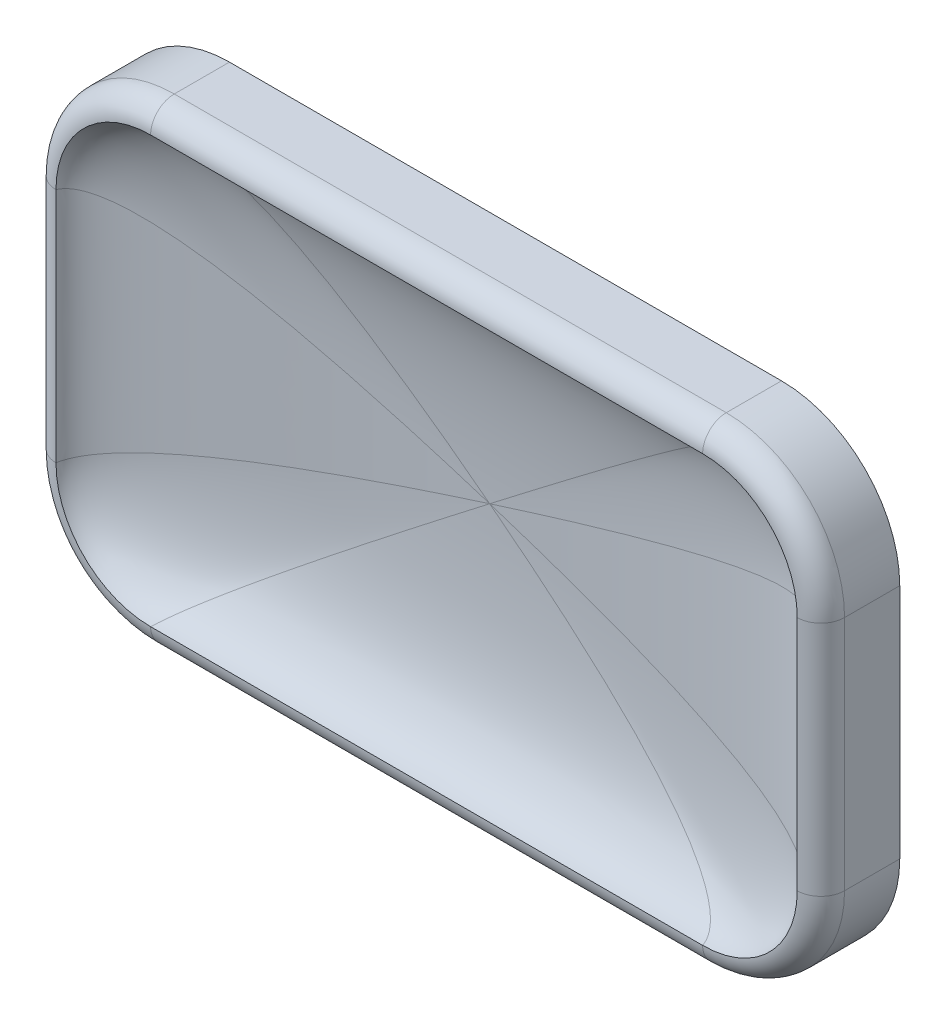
ISO-10303-21;
HEADER;
FILE_DESCRIPTION(('STEP AP214'),'2;1');
FILE_NAME('part.step','',(''),(''),'','','');
FILE_SCHEMA(('AUTOMOTIVE_DESIGN { 1 0 10303 214 1 1 1 1 }'));
ENDSEC;
DATA;
#1=APPLICATION_CONTEXT('core data for automotive mechanical design processes');
#2=APPLICATION_PROTOCOL_DEFINITION('international standard','automotive_design',2000,#1);
#3=PRODUCT_CONTEXT('',#1,'mechanical');
#4=PRODUCT('Part','Part','',(#3));
#5=PRODUCT_RELATED_PRODUCT_CATEGORY('part','',(#4));
#6=PRODUCT_DEFINITION_FORMATION('','',#4);
#7=PRODUCT_DEFINITION_CONTEXT('part definition',#1,'design');
#8=PRODUCT_DEFINITION('design','',#6,#7);
#9=PRODUCT_DEFINITION_SHAPE('','',#8);
#10=(LENGTH_UNIT() NAMED_UNIT(*) SI_UNIT(.MILLI.,.METRE.));
#11=(NAMED_UNIT(*) PLANE_ANGLE_UNIT() SI_UNIT($,.RADIAN.));
#12=(NAMED_UNIT(*) SI_UNIT($,.STERADIAN.) SOLID_ANGLE_UNIT());
#13=UNCERTAINTY_MEASURE_WITH_UNIT(LENGTH_MEASURE(1.E-05),#10,'distance_accuracy_value','');
#14=(GEOMETRIC_REPRESENTATION_CONTEXT(3) GLOBAL_UNCERTAINTY_ASSIGNED_CONTEXT((#13)) GLOBAL_UNIT_ASSIGNED_CONTEXT((#10,
#11,#12)) REPRESENTATION_CONTEXT('',''));
#15=CARTESIAN_POINT('',(0.,0.,0.));
#16=DIRECTION('',(0.,0.,1.));
#17=DIRECTION('',(1.,0.,0.));
#18=AXIS2_PLACEMENT_3D('',#15,#16,#17);
#19=CARTESIAN_POINT('',(0.,0.,10.));
#20=DIRECTION('',(1.,0.,0.));
#21=DIRECTION('',(0.,0.,-1.));
#22=AXIS2_PLACEMENT_3D('',#19,#20,#21);
#23=PLANE('',#22);
#24=DIRECTION('',(0.,0.,-1.));
#25=VECTOR('',#24,1.);
#26=CARTESIAN_POINT('',(0.,15.,10.));
#27=LINE('',#26,#25);
#28=CARTESIAN_POINT('',(0.,15.,0.));
#29=VERTEX_POINT('',#28);
#30=CARTESIAN_POINT('',(0.,15.,7.));
#31=VERTEX_POINT('',#30);
#32=EDGE_CURVE('E217',#29,#31,#27,.F.);
#33=ORIENTED_EDGE('',*,*,#32,.T.);
#34=DIRECTION('',(0.,-1.,0.));
#35=VECTOR('',#34,1.);
#36=CARTESIAN_POINT('',(0.,0.,7.));
#37=LINE('',#36,#35);
#38=CARTESIAN_POINT('',(0.,45.,7.));
#39=VERTEX_POINT('',#38);
#40=EDGE_CURVE('E59',#31,#39,#37,.F.);
#41=ORIENTED_EDGE('',*,*,#40,.T.);
#42=DIRECTION('',(0.,0.,-1.));
#43=VECTOR('',#42,1.);
#44=CARTESIAN_POINT('',(0.,45.,10.));
#45=LINE('',#44,#43);
#46=CARTESIAN_POINT('',(0.,45.,0.));
#47=VERTEX_POINT('',#46);
#48=EDGE_CURVE('E219',#39,#47,#45,.T.);
#49=ORIENTED_EDGE('',*,*,#48,.T.);
#50=DIRECTION('',(0.,-1.,0.));
#51=VECTOR('',#50,1.);
#52=CARTESIAN_POINT('',(0.,0.,0.));
#53=LINE('',#52,#51);
#54=EDGE_CURVE('E193',#47,#29,#53,.T.);
#55=ORIENTED_EDGE('',*,*,#54,.T.);
#56=EDGE_LOOP('',(#33,#41,#49,#55));
#57=FACE_BOUND('',#56,.T.);
#58=ADVANCED_FACE('F35',(#57),#23,.F.);
#59=CARTESIAN_POINT('',(0.,0.,10.));
#60=DIRECTION('',(0.,1.,0.));
#61=DIRECTION('',(0.,0.,1.));
#62=AXIS2_PLACEMENT_3D('',#59,#60,#61);
#63=PLANE('',#62);
#64=DIRECTION('',(0.,0.,-1.));
#65=VECTOR('',#64,1.);
#66=CARTESIAN_POINT('',(85.,0.,10.));
#67=LINE('',#66,#65);
#68=CARTESIAN_POINT('',(85.,0.,0.));
#69=VERTEX_POINT('',#68);
#70=CARTESIAN_POINT('',(85.,0.,7.));
#71=VERTEX_POINT('',#70);
#72=EDGE_CURVE('E240',#69,#71,#67,.F.);
#73=ORIENTED_EDGE('',*,*,#72,.T.);
#74=DIRECTION('',(1.,0.,0.));
#75=VECTOR('',#74,1.);
#76=CARTESIAN_POINT('',(0.,0.,7.));
#77=LINE('',#76,#75);
#78=CARTESIAN_POINT('',(15.,0.,7.));
#79=VERTEX_POINT('',#78);
#80=EDGE_CURVE('E171',#71,#79,#77,.F.);
#81=ORIENTED_EDGE('',*,*,#80,.T.);
#82=DIRECTION('',(0.,0.,-1.));
#83=VECTOR('',#82,1.);
#84=CARTESIAN_POINT('',(15.,0.,10.));
#85=LINE('',#84,#83);
#86=CARTESIAN_POINT('',(15.,0.,0.));
#87=VERTEX_POINT('',#86);
#88=EDGE_CURVE('E238',#79,#87,#85,.T.);
#89=ORIENTED_EDGE('',*,*,#88,.T.);
#90=DIRECTION('',(1.,0.,0.));
#91=VECTOR('',#90,1.);
#92=CARTESIAN_POINT('',(0.,0.,0.));
#93=LINE('',#92,#91);
#94=EDGE_CURVE('E199',#87,#69,#93,.T.);
#95=ORIENTED_EDGE('',*,*,#94,.T.);
#96=EDGE_LOOP('',(#73,#81,#89,#95));
#97=FACE_BOUND('',#96,.T.);
#98=ADVANCED_FACE('F272',(#97),#63,.F.);
#99=CARTESIAN_POINT('',(100.,0.,10.));
#100=DIRECTION('',(-1.,0.,0.));
#101=DIRECTION('',(0.,0.,1.));
#102=AXIS2_PLACEMENT_3D('',#99,#100,#101);
#103=PLANE('',#102);
#104=DIRECTION('',(0.,0.,-1.));
#105=VECTOR('',#104,1.);
#106=CARTESIAN_POINT('',(100.,45.,10.));
#107=LINE('',#106,#105);
#108=CARTESIAN_POINT('',(100.,45.,0.));
#109=VERTEX_POINT('',#108);
#110=CARTESIAN_POINT('',(100.,45.,7.));
#111=VERTEX_POINT('',#110);
#112=EDGE_CURVE('E235',#109,#111,#107,.F.);
#113=ORIENTED_EDGE('',*,*,#112,.T.);
#114=DIRECTION('',(0.,1.,0.));
#115=VECTOR('',#114,1.);
#116=CARTESIAN_POINT('',(100.,0.,7.));
#117=LINE('',#116,#115);
#118=CARTESIAN_POINT('',(100.,15.,7.));
#119=VERTEX_POINT('',#118);
#120=EDGE_CURVE('E154',#111,#119,#117,.F.);
#121=ORIENTED_EDGE('',*,*,#120,.T.);
#122=DIRECTION('',(0.,0.,-1.));
#123=VECTOR('',#122,1.);
#124=CARTESIAN_POINT('',(100.,15.,10.));
#125=LINE('',#124,#123);
#126=CARTESIAN_POINT('',(100.,15.,0.));
#127=VERTEX_POINT('',#126);
#128=EDGE_CURVE('E233',#119,#127,#125,.T.);
#129=ORIENTED_EDGE('',*,*,#128,.T.);
#130=DIRECTION('',(0.,1.,0.));
#131=VECTOR('',#130,1.);
#132=CARTESIAN_POINT('',(100.,0.,0.));
#133=LINE('',#132,#131);
#134=EDGE_CURVE('E204',#127,#109,#133,.T.);
#135=ORIENTED_EDGE('',*,*,#134,.T.);
#136=EDGE_LOOP('',(#113,#121,#129,#135));
#137=FACE_BOUND('',#136,.T.);
#138=ADVANCED_FACE('F294',(#137),#103,.F.);
#139=CARTESIAN_POINT('',(0.,60.,10.));
#140=DIRECTION('',(0.,-1.,0.));
#141=DIRECTION('',(0.,0.,-1.));
#142=AXIS2_PLACEMENT_3D('',#139,#140,#141);
#143=PLANE('',#142);
#144=DIRECTION('',(0.,0.,-1.));
#145=VECTOR('',#144,1.);
#146=CARTESIAN_POINT('',(15.,60.,10.));
#147=LINE('',#146,#145);
#148=CARTESIAN_POINT('',(15.,60.,0.));
#149=VERTEX_POINT('',#148);
#150=CARTESIAN_POINT('',(15.,60.,7.));
#151=VERTEX_POINT('',#150);
#152=EDGE_CURVE('E231',#149,#151,#147,.F.);
#153=ORIENTED_EDGE('',*,*,#152,.T.);
#154=DIRECTION('',(-1.,0.,0.));
#155=VECTOR('',#154,1.);
#156=CARTESIAN_POINT('',(0.,60.,7.));
#157=LINE('',#156,#155);
#158=CARTESIAN_POINT('',(85.,60.,7.));
#159=VERTEX_POINT('',#158);
#160=EDGE_CURVE('E11',#151,#159,#157,.F.);
#161=ORIENTED_EDGE('',*,*,#160,.T.);
#162=DIRECTION('',(0.,0.,-1.));
#163=VECTOR('',#162,1.);
#164=CARTESIAN_POINT('',(85.,60.,10.));
#165=LINE('',#164,#163);
#166=CARTESIAN_POINT('',(85.,60.,0.));
#167=VERTEX_POINT('',#166);
#168=EDGE_CURVE('E229',#159,#167,#165,.T.);
#169=ORIENTED_EDGE('',*,*,#168,.T.);
#170=DIRECTION('',(-1.,0.,0.));
#171=VECTOR('',#170,1.);
#172=CARTESIAN_POINT('',(0.,60.,0.));
#173=LINE('',#172,#171);
#174=EDGE_CURVE('E214',#167,#149,#173,.T.);
#175=ORIENTED_EDGE('',*,*,#174,.T.);
#176=EDGE_LOOP('',(#153,#161,#169,#175));
#177=FACE_BOUND('',#176,.T.);
#178=ADVANCED_FACE('F355',(#177),#143,.F.);
#179=CARTESIAN_POINT('',(0.,60.,0.));
#180=DIRECTION('',(0.,0.,-1.));
#181=DIRECTION('',(-1.,0.,0.));
#182=AXIS2_PLACEMENT_3D('',#179,#180,#181);
#183=PLANE('',#182);
#184=ORIENTED_EDGE('',*,*,#54,.F.);
#185=CARTESIAN_POINT('',(15.,45.,0.));
#186=DIRECTION('',(0.,0.,-1.));
#187=DIRECTION('',(-1.,0.,0.));
#188=AXIS2_PLACEMENT_3D('',#185,#186,#187);
#189=CIRCLE('',#188,15.);
#190=EDGE_CURVE('E227',#47,#149,#189,.T.);
#191=ORIENTED_EDGE('',*,*,#190,.T.);
#192=ORIENTED_EDGE('',*,*,#174,.F.);
#193=CARTESIAN_POINT('',(85.,45.,0.));
#194=DIRECTION('',(0.,0.,-1.));
#195=DIRECTION('',(-1.,0.,0.));
#196=AXIS2_PLACEMENT_3D('',#193,#194,#195);
#197=CIRCLE('',#196,15.);
#198=EDGE_CURVE('E225',#167,#109,#197,.T.);
#199=ORIENTED_EDGE('',*,*,#198,.T.);
#200=ORIENTED_EDGE('',*,*,#134,.F.);
#201=CARTESIAN_POINT('',(85.,15.,0.));
#202=DIRECTION('',(0.,0.,-1.));
#203=DIRECTION('',(-1.,0.,0.));
#204=AXIS2_PLACEMENT_3D('',#201,#202,#203);
#205=CIRCLE('',#204,15.);
#206=EDGE_CURVE('E223',#127,#69,#205,.T.);
#207=ORIENTED_EDGE('',*,*,#206,.T.);
#208=ORIENTED_EDGE('',*,*,#94,.F.);
#209=CARTESIAN_POINT('',(15.,15.,0.));
#210=DIRECTION('',(0.,0.,-1.));
#211=DIRECTION('',(-1.,0.,0.));
#212=AXIS2_PLACEMENT_3D('',#209,#210,#211);
#213=CIRCLE('',#212,15.);
#214=EDGE_CURVE('E221',#87,#29,#213,.T.);
#215=ORIENTED_EDGE('',*,*,#214,.T.);
#216=EDGE_LOOP('',(#184,#191,#192,#199,#200,#207,#208,#215));
#217=FACE_BOUND('',#216,.T.);
#218=ADVANCED_FACE('F302',(#217),#183,.T.);
#219=CARTESIAN_POINT('',(15.,45.,10.));
#220=DIRECTION('',(0.,0.,-1.));
#221=DIRECTION('',(-1.,0.,0.));
#222=AXIS2_PLACEMENT_3D('',#219,#220,#221);
#223=CYLINDRICAL_SURFACE('',#222,15.);
#224=ORIENTED_EDGE('',*,*,#48,.F.);
#225=CARTESIAN_POINT('',(15.,45.,7.));
#226=DIRECTION('',(0.,0.,-1.));
#227=DIRECTION('',(-1.,0.,0.));
#228=AXIS2_PLACEMENT_3D('',#225,#226,#227);
#229=CIRCLE('',#228,15.);
#230=EDGE_CURVE('E44',#39,#151,#229,.T.);
#231=ORIENTED_EDGE('',*,*,#230,.T.);
#232=ORIENTED_EDGE('',*,*,#152,.F.);
#233=ORIENTED_EDGE('',*,*,#190,.F.);
#234=EDGE_LOOP('',(#224,#231,#232,#233));
#235=FACE_BOUND('',#234,.T.);
#236=ADVANCED_FACE('F298',(#235),#223,.T.);
#237=CARTESIAN_POINT('',(85.,45.,10.));
#238=DIRECTION('',(0.,0.,-1.));
#239=DIRECTION('',(-1.,0.,0.));
#240=AXIS2_PLACEMENT_3D('',#237,#238,#239);
#241=CYLINDRICAL_SURFACE('',#240,15.);
#242=ORIENTED_EDGE('',*,*,#168,.F.);
#243=CARTESIAN_POINT('',(85.,45.,7.));
#244=DIRECTION('',(0.,0.,-1.));
#245=DIRECTION('',(-1.,0.,0.));
#246=AXIS2_PLACEMENT_3D('',#243,#244,#245);
#247=CIRCLE('',#246,15.);
#248=EDGE_CURVE('E163',#159,#111,#247,.T.);
#249=ORIENTED_EDGE('',*,*,#248,.T.);
#250=ORIENTED_EDGE('',*,*,#112,.F.);
#251=ORIENTED_EDGE('',*,*,#198,.F.);
#252=EDGE_LOOP('',(#242,#249,#250,#251));
#253=FACE_BOUND('',#252,.T.);
#254=ADVANCED_FACE('F301',(#253),#241,.T.);
#255=CARTESIAN_POINT('',(85.,15.,10.));
#256=DIRECTION('',(0.,0.,-1.));
#257=DIRECTION('',(-1.,0.,0.));
#258=AXIS2_PLACEMENT_3D('',#255,#256,#257);
#259=CYLINDRICAL_SURFACE('',#258,15.);
#260=ORIENTED_EDGE('',*,*,#128,.F.);
#261=CARTESIAN_POINT('',(85.,15.,7.));
#262=DIRECTION('',(0.,0.,-1.));
#263=DIRECTION('',(-1.,0.,0.));
#264=AXIS2_PLACEMENT_3D('',#261,#262,#263);
#265=CIRCLE('',#264,15.);
#266=EDGE_CURVE('E169',#119,#71,#265,.T.);
#267=ORIENTED_EDGE('',*,*,#266,.T.);
#268=ORIENTED_EDGE('',*,*,#72,.F.);
#269=ORIENTED_EDGE('',*,*,#206,.F.);
#270=EDGE_LOOP('',(#260,#267,#268,#269));
#271=FACE_BOUND('',#270,.T.);
#272=ADVANCED_FACE('F269',(#271),#259,.T.);
#273=CARTESIAN_POINT('',(15.,15.,10.));
#274=DIRECTION('',(0.,0.,-1.));
#275=DIRECTION('',(-1.,0.,0.));
#276=AXIS2_PLACEMENT_3D('',#273,#274,#275);
#277=CYLINDRICAL_SURFACE('',#276,15.);
#278=ORIENTED_EDGE('',*,*,#88,.F.);
#279=CARTESIAN_POINT('',(15.,15.,7.));
#280=DIRECTION('',(0.,0.,-1.));
#281=DIRECTION('',(-1.,0.,0.));
#282=AXIS2_PLACEMENT_3D('',#279,#280,#281);
#283=CIRCLE('',#282,15.);
#284=EDGE_CURVE('E173',#79,#31,#283,.T.);
#285=ORIENTED_EDGE('',*,*,#284,.T.);
#286=ORIENTED_EDGE('',*,*,#32,.F.);
#287=ORIENTED_EDGE('',*,*,#214,.F.);
#288=EDGE_LOOP('',(#278,#285,#286,#287));
#289=FACE_BOUND('',#288,.T.);
#290=ADVANCED_FACE('F287',(#289),#277,.T.);
#291=CARTESIAN_POINT('',(15.,15.,7.));
#292=DIRECTION('',(0.,0.,-1.));
#293=DIRECTION('',(-1.,0.,0.));
#294=AXIS2_PLACEMENT_3D('',#291,#292,#293);
#295=TOROIDAL_SURFACE('',#294,12.,3.);
#296=CARTESIAN_POINT('',(3.,15.,7.));
#297=DIRECTION('',(0.,1.,0.));
#298=DIRECTION('',(0.,0.,1.));
#299=AXIS2_PLACEMENT_3D('',#296,#297,#298);
#300=CIRCLE('',#299,3.);
#301=CARTESIAN_POINT('',(3.,15.,10.));
#302=VERTEX_POINT('',#301);
#303=EDGE_CURVE('E187',#31,#302,#300,.T.);
#304=ORIENTED_EDGE('',*,*,#303,.F.);
#305=ORIENTED_EDGE('',*,*,#284,.F.);
#306=CARTESIAN_POINT('',(15.,3.,7.));
#307=DIRECTION('',(1.,0.,0.));
#308=DIRECTION('',(0.,0.,-1.));
#309=AXIS2_PLACEMENT_3D('',#306,#307,#308);
#310=CIRCLE('',#309,3.);
#311=CARTESIAN_POINT('',(15.,3.,10.));
#312=VERTEX_POINT('',#311);
#313=EDGE_CURVE('E39',#312,#79,#310,.T.);
#314=ORIENTED_EDGE('',*,*,#313,.F.);
#315=CARTESIAN_POINT('',(15.,15.,10.));
#316=DIRECTION('',(0.,0.,-1.));
#317=DIRECTION('',(-1.,0.,0.));
#318=AXIS2_PLACEMENT_3D('',#315,#316,#317);
#319=CIRCLE('',#318,12.);
#320=EDGE_CURVE('E252',#302,#312,#319,.F.);
#321=ORIENTED_EDGE('',*,*,#320,.F.);
#322=EDGE_LOOP('',(#304,#305,#314,#321));
#323=FACE_BOUND('',#322,.T.);
#324=ADVANCED_FACE('F37',(#323),#295,.T.);
#325=CARTESIAN_POINT('',(0.,3.,7.));
#326=DIRECTION('',(1.,0.,0.));
#327=DIRECTION('',(0.,0.,-1.));
#328=AXIS2_PLACEMENT_3D('',#325,#326,#327);
#329=CYLINDRICAL_SURFACE('',#328,3.);
#330=ORIENTED_EDGE('',*,*,#313,.T.);
#331=ORIENTED_EDGE('',*,*,#80,.F.);
#332=CARTESIAN_POINT('',(85.,3.,7.));
#333=DIRECTION('',(1.,0.,0.));
#334=DIRECTION('',(0.,0.,-1.));
#335=AXIS2_PLACEMENT_3D('',#332,#333,#334);
#336=CIRCLE('',#335,3.);
#337=CARTESIAN_POINT('',(85.,3.,10.));
#338=VERTEX_POINT('',#337);
#339=EDGE_CURVE('E185',#338,#71,#336,.T.);
#340=ORIENTED_EDGE('',*,*,#339,.F.);
#341=DIRECTION('',(1.,0.,0.));
#342=VECTOR('',#341,1.);
#343=CARTESIAN_POINT('',(0.,3.,10.));
#344=LINE('',#343,#342);
#345=EDGE_CURVE('E255',#312,#338,#344,.T.);
#346=ORIENTED_EDGE('',*,*,#345,.F.);
#347=EDGE_LOOP('',(#330,#331,#340,#346));
#348=FACE_BOUND('',#347,.T.);
#349=ADVANCED_FACE('F275',(#348),#329,.T.);
#350=CARTESIAN_POINT('',(3.,60.,7.));
#351=DIRECTION('',(0.,-1.,0.));
#352=DIRECTION('',(0.,0.,-1.));
#353=AXIS2_PLACEMENT_3D('',#350,#351,#352);
#354=CYLINDRICAL_SURFACE('',#353,3.);
#355=ORIENTED_EDGE('',*,*,#303,.T.);
#356=DIRECTION('',(0.,-1.,0.));
#357=VECTOR('',#356,1.);
#358=CARTESIAN_POINT('',(3.,60.,10.));
#359=LINE('',#358,#357);
#360=CARTESIAN_POINT('',(3.,45.,10.));
#361=VERTEX_POINT('',#360);
#362=EDGE_CURVE('E249',#361,#302,#359,.T.);
#363=ORIENTED_EDGE('',*,*,#362,.F.);
#364=CARTESIAN_POINT('',(3.,45.,7.));
#365=DIRECTION('',(0.,1.,0.));
#366=DIRECTION('',(0.,0.,1.));
#367=AXIS2_PLACEMENT_3D('',#364,#365,#366);
#368=CIRCLE('',#367,3.);
#369=EDGE_CURVE('E182',#39,#361,#368,.T.);
#370=ORIENTED_EDGE('',*,*,#369,.F.);
#371=ORIENTED_EDGE('',*,*,#40,.F.);
#372=EDGE_LOOP('',(#355,#363,#370,#371));
#373=FACE_BOUND('',#372,.T.);
#374=ADVANCED_FACE('F324',(#373),#354,.T.);
#375=CARTESIAN_POINT('',(85.,15.,7.));
#376=DIRECTION('',(0.,0.,-1.));
#377=DIRECTION('',(-1.,0.,0.));
#378=AXIS2_PLACEMENT_3D('',#375,#376,#377);
#379=TOROIDAL_SURFACE('',#378,12.,3.);
#380=ORIENTED_EDGE('',*,*,#339,.T.);
#381=ORIENTED_EDGE('',*,*,#266,.F.);
#382=CARTESIAN_POINT('',(97.,15.,7.));
#383=DIRECTION('',(0.,1.,0.));
#384=DIRECTION('',(0.,0.,1.));
#385=AXIS2_PLACEMENT_3D('',#382,#383,#384);
#386=CIRCLE('',#385,3.);
#387=CARTESIAN_POINT('',(97.,15.,10.));
#388=VERTEX_POINT('',#387);
#389=EDGE_CURVE('E180',#388,#119,#386,.T.);
#390=ORIENTED_EDGE('',*,*,#389,.F.);
#391=CARTESIAN_POINT('',(85.,15.,10.));
#392=DIRECTION('',(0.,0.,-1.));
#393=DIRECTION('',(-1.,0.,0.));
#394=AXIS2_PLACEMENT_3D('',#391,#392,#393);
#395=CIRCLE('',#394,12.);
#396=EDGE_CURVE('E149',#338,#388,#395,.F.);
#397=ORIENTED_EDGE('',*,*,#396,.F.);
#398=EDGE_LOOP('',(#380,#381,#390,#397));
#399=FACE_BOUND('',#398,.T.);
#400=ADVANCED_FACE('F265',(#399),#379,.T.);
#401=CARTESIAN_POINT('',(15.,45.,7.));
#402=DIRECTION('',(0.,0.,-1.));
#403=DIRECTION('',(-1.,0.,0.));
#404=AXIS2_PLACEMENT_3D('',#401,#402,#403);
#405=TOROIDAL_SURFACE('',#404,12.,3.);
#406=ORIENTED_EDGE('',*,*,#369,.T.);
#407=CARTESIAN_POINT('',(15.,45.,10.));
#408=DIRECTION('',(0.,0.,-1.));
#409=DIRECTION('',(-1.,0.,0.));
#410=AXIS2_PLACEMENT_3D('',#407,#408,#409);
#411=CIRCLE('',#410,12.);
#412=CARTESIAN_POINT('',(15.,57.,10.));
#413=VERTEX_POINT('',#412);
#414=EDGE_CURVE('E246',#413,#361,#411,.F.);
#415=ORIENTED_EDGE('',*,*,#414,.F.);
#416=CARTESIAN_POINT('',(15.,57.,7.));
#417=DIRECTION('',(1.,0.,0.));
#418=DIRECTION('',(0.,0.,-1.));
#419=AXIS2_PLACEMENT_3D('',#416,#417,#418);
#420=CIRCLE('',#419,3.);
#421=EDGE_CURVE('E158',#151,#413,#420,.T.);
#422=ORIENTED_EDGE('',*,*,#421,.F.);
#423=ORIENTED_EDGE('',*,*,#230,.F.);
#424=EDGE_LOOP('',(#406,#415,#422,#423));
#425=FACE_BOUND('',#424,.T.);
#426=ADVANCED_FACE('F318',(#425),#405,.T.);
#427=CARTESIAN_POINT('',(97.,60.,7.));
#428=DIRECTION('',(0.,1.,0.));
#429=DIRECTION('',(0.,0.,1.));
#430=AXIS2_PLACEMENT_3D('',#427,#428,#429);
#431=CYLINDRICAL_SURFACE('',#430,3.);
#432=ORIENTED_EDGE('',*,*,#389,.T.);
#433=ORIENTED_EDGE('',*,*,#120,.F.);
#434=CARTESIAN_POINT('',(97.,45.,7.));
#435=DIRECTION('',(0.,1.,0.));
#436=DIRECTION('',(0.,0.,1.));
#437=AXIS2_PLACEMENT_3D('',#434,#435,#436);
#438=CIRCLE('',#437,3.);
#439=CARTESIAN_POINT('',(97.,45.,10.));
#440=VERTEX_POINT('',#439);
#441=EDGE_CURVE('E152',#440,#111,#438,.T.);
#442=ORIENTED_EDGE('',*,*,#441,.F.);
#443=DIRECTION('',(0.,1.,0.));
#444=VECTOR('',#443,1.);
#445=CARTESIAN_POINT('',(97.,60.,10.));
#446=LINE('',#445,#444);
#447=EDGE_CURVE('E143',#388,#440,#446,.T.);
#448=ORIENTED_EDGE('',*,*,#447,.F.);
#449=EDGE_LOOP('',(#432,#433,#442,#448));
#450=FACE_BOUND('',#449,.T.);
#451=ADVANCED_FACE('F153',(#450),#431,.T.);
#452=CARTESIAN_POINT('',(0.,57.,7.));
#453=DIRECTION('',(-1.,0.,0.));
#454=DIRECTION('',(0.,0.,1.));
#455=AXIS2_PLACEMENT_3D('',#452,#453,#454);
#456=CYLINDRICAL_SURFACE('',#455,3.);
#457=ORIENTED_EDGE('',*,*,#421,.T.);
#458=DIRECTION('',(-1.,0.,0.));
#459=VECTOR('',#458,1.);
#460=CARTESIAN_POINT('',(0.,57.,10.));
#461=LINE('',#460,#459);
#462=CARTESIAN_POINT('',(85.,57.,10.));
#463=VERTEX_POINT('',#462);
#464=EDGE_CURVE('E243',#463,#413,#461,.T.);
#465=ORIENTED_EDGE('',*,*,#464,.F.);
#466=CARTESIAN_POINT('',(85.,57.,7.));
#467=DIRECTION('',(1.,0.,0.));
#468=DIRECTION('',(0.,0.,-1.));
#469=AXIS2_PLACEMENT_3D('',#466,#467,#468);
#470=CIRCLE('',#469,3.);
#471=EDGE_CURVE('E139',#159,#463,#470,.T.);
#472=ORIENTED_EDGE('',*,*,#471,.F.);
#473=ORIENTED_EDGE('',*,*,#160,.F.);
#474=EDGE_LOOP('',(#457,#465,#472,#473));
#475=FACE_BOUND('',#474,.T.);
#476=ADVANCED_FACE('F312',(#475),#456,.T.);
#477=CARTESIAN_POINT('',(85.,45.,7.));
#478=DIRECTION('',(0.,0.,-1.));
#479=DIRECTION('',(-1.,0.,0.));
#480=AXIS2_PLACEMENT_3D('',#477,#478,#479);
#481=TOROIDAL_SURFACE('',#480,12.,3.);
#482=ORIENTED_EDGE('',*,*,#441,.T.);
#483=ORIENTED_EDGE('',*,*,#248,.F.);
#484=ORIENTED_EDGE('',*,*,#471,.T.);
#485=CARTESIAN_POINT('',(85.,45.,10.));
#486=DIRECTION('',(0.,0.,-1.));
#487=DIRECTION('',(-1.,0.,0.));
#488=AXIS2_PLACEMENT_3D('',#485,#486,#487);
#489=CIRCLE('',#488,12.);
#490=EDGE_CURVE('E134',#440,#463,#489,.F.);
#491=ORIENTED_EDGE('',*,*,#490,.F.);
#492=EDGE_LOOP('',(#482,#483,#484,#491));
#493=FACE_BOUND('',#492,.T.);
#494=ADVANCED_FACE('F160',(#493),#481,.T.);
#495=CARTESIAN_POINT('',(15.,3.,10.));
#496=CARTESIAN_POINT('',(16.75,4.35,2.));
#497=CARTESIAN_POINT('',(50.,30.,2.));
#498=CARTESIAN_POINT('',(85.,3.,10.));
#499=CARTESIAN_POINT('',(83.25,4.35,2.));
#500=CARTESIAN_POINT('',(50.,30.,2.));
#501=(BOUNDED_SURFACE() B_SPLINE_SURFACE(1,2,((#495,#496,#497),(#498,#499,#500)),.UNSPECIFIED.,
.F.,.F.,.F.) B_SPLINE_SURFACE_WITH_KNOTS((2,2),(3,3),(0.,1.),(0.,1.),
.UNSPECIFIED.) GEOMETRIC_REPRESENTATION_ITEM() RATIONAL_B_SPLINE_SURFACE(((1.,1.,1.),(1.,1.,1.))) REPRESENTATION_ITEM('') SURFACE());
#502=CARTESIAN_POINT('',(85.,3.,10.));
#503=CARTESIAN_POINT('',(83.25,4.35,2.));
#504=CARTESIAN_POINT('',(50.,30.,2.));
#505=(BOUNDED_CURVE() B_SPLINE_CURVE(2,(#502,#503,#504),.UNSPECIFIED.,.F.,
.F.) B_SPLINE_CURVE_WITH_KNOTS((3,3),(0.,1.),
.UNSPECIFIED.) CURVE() GEOMETRIC_REPRESENTATION_ITEM() RATIONAL_B_SPLINE_CURVE((1.,1.,1.)) REPRESENTATION_ITEM(''));
#506=CARTESIAN_POINT('',(50.,30.,2.));
#507=VERTEX_POINT('',#506);
#508=EDGE_CURVE('E207',#338,#507,#505,.T.);
#509=CARTESIAN_POINT('',(15.,3.,10.));
#510=CARTESIAN_POINT('',(16.75,4.35,2.));
#511=CARTESIAN_POINT('',(50.,30.,2.));
#512=(BOUNDED_CURVE() B_SPLINE_CURVE(2,(#509,#510,#511),.UNSPECIFIED.,.F.,
.F.) B_SPLINE_CURVE_WITH_KNOTS((3,3),(0.,1.),
.UNSPECIFIED.) CURVE() GEOMETRIC_REPRESENTATION_ITEM() RATIONAL_B_SPLINE_CURVE((1.,1.,1.)) REPRESENTATION_ITEM(''));
#513=EDGE_CURVE('E278',#312,#507,#512,.T.);
#514=ORIENTED_EDGE('',*,*,#345,.T.);
#515=ORIENTED_EDGE('',*,*,#508,.T.);
#516=ORIENTED_EDGE('',*,*,#513,.F.);
#517=EDGE_LOOP('',(#514,#515,#516));
#518=FACE_BOUND('',#517,.T.);
#519=ADVANCED_FACE('F277',(#518),#501,.T.);
#520=CARTESIAN_POINT('',(3.,15.,10.));
#521=CARTESIAN_POINT('',(5.35,15.75,2.));
#522=CARTESIAN_POINT('',(50.,30.,2.));
#523=CARTESIAN_POINT('',(3.,7.97056274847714,10.));
#524=CARTESIAN_POINT('',(5.35,9.07203461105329,2.));
#525=CARTESIAN_POINT('',(50.,30.,2.));
#526=CARTESIAN_POINT('',(7.97056274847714,3.,10.));
#527=CARTESIAN_POINT('',(10.0720346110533,4.35,2.));
#528=CARTESIAN_POINT('',(50.,30.,2.));
#529=CARTESIAN_POINT('',(15.,3.,10.));
#530=CARTESIAN_POINT('',(16.75,4.35,2.));
#531=CARTESIAN_POINT('',(50.,30.,2.));
#532=(BOUNDED_SURFACE() B_SPLINE_SURFACE(3,2,((#520,#521,#522),(#523,#524,#525),(#526,#527,
#528),(#529,#530,#531)),.UNSPECIFIED.,.F.,.F.,.F.) B_SPLINE_SURFACE_WITH_KNOTS((4,4),(3,3),(0.,
1.),(0.,1.),.UNSPECIFIED.) GEOMETRIC_REPRESENTATION_ITEM() RATIONAL_B_SPLINE_SURFACE(((1.,1.,
1.),(0.804737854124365,0.804737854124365,0.804737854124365),(0.804737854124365,
0.804737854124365,0.804737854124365),(1.,1.,1.))) REPRESENTATION_ITEM('') SURFACE());
#533=CARTESIAN_POINT('',(3.,15.,10.));
#534=CARTESIAN_POINT('',(5.35000000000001,15.75,2.));
#535=CARTESIAN_POINT('',(50.,30.,2.));
#536=(BOUNDED_CURVE() B_SPLINE_CURVE(2,(#533,#534,#535),.UNSPECIFIED.,.F.,
.F.) B_SPLINE_CURVE_WITH_KNOTS((3,3),(0.,1.),
.UNSPECIFIED.) CURVE() GEOMETRIC_REPRESENTATION_ITEM() RATIONAL_B_SPLINE_CURVE((1.,1.,1.)) REPRESENTATION_ITEM(''));
#537=EDGE_CURVE('E281',#302,#507,#536,.T.);
#538=ORIENTED_EDGE('',*,*,#320,.T.);
#539=ORIENTED_EDGE('',*,*,#513,.T.);
#540=ORIENTED_EDGE('',*,*,#537,.F.);
#541=EDGE_LOOP('',(#538,#539,#540));
#542=FACE_BOUND('',#541,.T.);
#543=ADVANCED_FACE('F283',(#542),#532,.T.);
#544=CARTESIAN_POINT('',(3.,45.,10.));
#545=CARTESIAN_POINT('',(5.35000000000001,44.25,2.));
#546=CARTESIAN_POINT('',(50.,30.,2.));
#547=CARTESIAN_POINT('',(3.,15.,10.));
#548=CARTESIAN_POINT('',(5.35000000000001,15.75,2.));
#549=CARTESIAN_POINT('',(50.,30.,2.));
#550=(BOUNDED_SURFACE() B_SPLINE_SURFACE(1,2,((#544,#545,#546),(#547,#548,#549)),.UNSPECIFIED.,
.F.,.F.,.F.) B_SPLINE_SURFACE_WITH_KNOTS((2,2),(3,3),(0.,1.),(0.,1.),
.UNSPECIFIED.) GEOMETRIC_REPRESENTATION_ITEM() RATIONAL_B_SPLINE_SURFACE(((1.,1.,1.),(1.,1.,1.))) REPRESENTATION_ITEM('') SURFACE());
#551=CARTESIAN_POINT('',(3.,45.,10.));
#552=CARTESIAN_POINT('',(5.35,44.25,2.));
#553=CARTESIAN_POINT('',(50.,30.,2.));
#554=(BOUNDED_CURVE() B_SPLINE_CURVE(2,(#551,#552,#553),.UNSPECIFIED.,.F.,
.F.) B_SPLINE_CURVE_WITH_KNOTS((3,3),(0.,1.),
.UNSPECIFIED.) CURVE() GEOMETRIC_REPRESENTATION_ITEM() RATIONAL_B_SPLINE_CURVE((1.,1.,1.)) REPRESENTATION_ITEM(''));
#555=EDGE_CURVE('E584',#361,#507,#554,.T.);
#556=ORIENTED_EDGE('',*,*,#362,.T.);
#557=ORIENTED_EDGE('',*,*,#537,.T.);
#558=ORIENTED_EDGE('',*,*,#555,.F.);
#559=EDGE_LOOP('',(#556,#557,#558));
#560=FACE_BOUND('',#559,.T.);
#561=ADVANCED_FACE('F452',(#560),#550,.T.);
#562=CARTESIAN_POINT('',(15.,57.,10.));
#563=CARTESIAN_POINT('',(16.75,55.65,2.));
#564=CARTESIAN_POINT('',(50.,30.,2.));
#565=CARTESIAN_POINT('',(7.97056274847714,57.,10.));
#566=CARTESIAN_POINT('',(10.0720346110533,55.65,2.));
#567=CARTESIAN_POINT('',(50.,30.,2.));
#568=CARTESIAN_POINT('',(3.,52.0294372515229,10.));
#569=CARTESIAN_POINT('',(5.35,50.9279653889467,2.));
#570=CARTESIAN_POINT('',(50.,30.,2.));
#571=CARTESIAN_POINT('',(3.,45.,10.));
#572=CARTESIAN_POINT('',(5.35,44.25,2.));
#573=CARTESIAN_POINT('',(50.,30.,2.));
#574=(BOUNDED_SURFACE() B_SPLINE_SURFACE(3,2,((#562,#563,#564),(#565,#566,#567),(#568,#569,
#570),(#571,#572,#573)),.UNSPECIFIED.,.F.,.F.,.F.) B_SPLINE_SURFACE_WITH_KNOTS((4,4),(3,3),(0.,
1.),(0.,1.),.UNSPECIFIED.) GEOMETRIC_REPRESENTATION_ITEM() RATIONAL_B_SPLINE_SURFACE(((1.,1.,
1.),(0.804737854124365,0.804737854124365,0.804737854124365),(0.804737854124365,
0.804737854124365,0.804737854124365),(1.,1.,1.))) REPRESENTATION_ITEM('') SURFACE());
#575=CARTESIAN_POINT('',(15.,57.,10.));
#576=CARTESIAN_POINT('',(16.75,55.65,2.));
#577=CARTESIAN_POINT('',(50.,30.,2.));
#578=(BOUNDED_CURVE() B_SPLINE_CURVE(2,(#575,#576,#577),.UNSPECIFIED.,.F.,
.F.) B_SPLINE_CURVE_WITH_KNOTS((3,3),(0.,1.),
.UNSPECIFIED.) CURVE() GEOMETRIC_REPRESENTATION_ITEM() RATIONAL_B_SPLINE_CURVE((1.,1.,1.)) REPRESENTATION_ITEM(''));
#579=EDGE_CURVE('E573',#413,#507,#578,.T.);
#580=ORIENTED_EDGE('',*,*,#414,.T.);
#581=ORIENTED_EDGE('',*,*,#555,.T.);
#582=ORIENTED_EDGE('',*,*,#579,.F.);
#583=EDGE_LOOP('',(#580,#581,#582));
#584=FACE_BOUND('',#583,.T.);
#585=ADVANCED_FACE('F460',(#584),#574,.T.);
#586=CARTESIAN_POINT('',(85.,57.,10.));
#587=CARTESIAN_POINT('',(83.25,55.65,2.));
#588=CARTESIAN_POINT('',(50.,30.,2.));
#589=CARTESIAN_POINT('',(15.,57.,10.));
#590=CARTESIAN_POINT('',(16.75,55.65,2.));
#591=CARTESIAN_POINT('',(50.,30.,2.));
#592=(BOUNDED_SURFACE() B_SPLINE_SURFACE(1,2,((#586,#587,#588),(#589,#590,#591)),.UNSPECIFIED.,
.F.,.F.,.F.) B_SPLINE_SURFACE_WITH_KNOTS((2,2),(3,3),(0.,1.),(0.,1.),
.UNSPECIFIED.) GEOMETRIC_REPRESENTATION_ITEM() RATIONAL_B_SPLINE_SURFACE(((1.,1.,1.),(1.,1.,1.))) REPRESENTATION_ITEM('') SURFACE());
#593=CARTESIAN_POINT('',(85.,57.,10.));
#594=CARTESIAN_POINT('',(83.25,55.65,2.));
#595=CARTESIAN_POINT('',(50.,30.,2.));
#596=(BOUNDED_CURVE() B_SPLINE_CURVE(2,(#593,#594,#595),.UNSPECIFIED.,.F.,
.F.) B_SPLINE_CURVE_WITH_KNOTS((3,3),(0.,1.),
.UNSPECIFIED.) CURVE() GEOMETRIC_REPRESENTATION_ITEM() RATIONAL_B_SPLINE_CURVE((1.,1.,1.)) REPRESENTATION_ITEM(''));
#597=EDGE_CURVE('E136',#463,#507,#596,.T.);
#598=ORIENTED_EDGE('',*,*,#464,.T.);
#599=ORIENTED_EDGE('',*,*,#579,.T.);
#600=ORIENTED_EDGE('',*,*,#597,.F.);
#601=EDGE_LOOP('',(#598,#599,#600));
#602=FACE_BOUND('',#601,.T.);
#603=ADVANCED_FACE('F469',(#602),#592,.T.);
#604=CARTESIAN_POINT('',(85.,3.,10.));
#605=CARTESIAN_POINT('',(83.25,4.35,2.));
#606=CARTESIAN_POINT('',(50.,30.,2.));
#607=CARTESIAN_POINT('',(92.0294372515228,3.,10.));
#608=CARTESIAN_POINT('',(89.9279653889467,4.35,2.));
#609=CARTESIAN_POINT('',(50.,30.,2.));
#610=CARTESIAN_POINT('',(97.,7.97056274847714,10.));
#611=CARTESIAN_POINT('',(94.65,9.07203461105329,2.));
#612=CARTESIAN_POINT('',(50.,30.,2.));
#613=CARTESIAN_POINT('',(97.,15.,10.));
#614=CARTESIAN_POINT('',(94.65,15.75,2.));
#615=CARTESIAN_POINT('',(50.,30.,2.));
#616=(BOUNDED_SURFACE() B_SPLINE_SURFACE(3,2,((#604,#605,#606),(#607,#608,#609),(#610,#611,
#612),(#613,#614,#615)),.UNSPECIFIED.,.F.,.F.,.F.) B_SPLINE_SURFACE_WITH_KNOTS((4,4),(3,3),(0.,
1.),(0.,1.),.UNSPECIFIED.) GEOMETRIC_REPRESENTATION_ITEM() RATIONAL_B_SPLINE_SURFACE(((1.,1.,
1.),(0.804737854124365,0.804737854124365,0.804737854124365),(0.804737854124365,
0.804737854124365,0.804737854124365),(1.,1.,1.))) REPRESENTATION_ITEM('') SURFACE());
#617=CARTESIAN_POINT('',(97.,15.,10.));
#618=CARTESIAN_POINT('',(94.65,15.75,2.));
#619=CARTESIAN_POINT('',(50.,30.,2.));
#620=(BOUNDED_CURVE() B_SPLINE_CURVE(2,(#617,#618,#619),.UNSPECIFIED.,.F.,
.F.) B_SPLINE_CURVE_WITH_KNOTS((3,3),(0.,1.),
.UNSPECIFIED.) CURVE() GEOMETRIC_REPRESENTATION_ITEM() RATIONAL_B_SPLINE_CURVE((1.,1.,1.)) REPRESENTATION_ITEM(''));
#621=EDGE_CURVE('E140',#507,#388,#620,.F.);
#622=ORIENTED_EDGE('',*,*,#396,.T.);
#623=ORIENTED_EDGE('',*,*,#621,.F.);
#624=ORIENTED_EDGE('',*,*,#508,.F.);
#625=EDGE_LOOP('',(#622,#623,#624));
#626=FACE_BOUND('',#625,.T.);
#627=ADVANCED_FACE('F260',(#626),#616,.T.);
#628=CARTESIAN_POINT('',(97.,45.,10.));
#629=CARTESIAN_POINT('',(94.65,44.25,2.));
#630=CARTESIAN_POINT('',(50.,30.,2.));
#631=CARTESIAN_POINT('',(97.,52.0294372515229,10.));
#632=CARTESIAN_POINT('',(94.65,50.9279653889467,2.));
#633=CARTESIAN_POINT('',(50.,30.,2.));
#634=CARTESIAN_POINT('',(92.0294372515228,57.,10.));
#635=CARTESIAN_POINT('',(89.9279653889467,55.65,2.));
#636=CARTESIAN_POINT('',(50.,30.,2.));
#637=CARTESIAN_POINT('',(85.,57.,10.));
#638=CARTESIAN_POINT('',(83.25,55.65,2.));
#639=CARTESIAN_POINT('',(50.,30.,2.));
#640=(BOUNDED_SURFACE() B_SPLINE_SURFACE(3,2,((#628,#629,#630),(#631,#632,#633),(#634,#635,
#636),(#637,#638,#639)),.UNSPECIFIED.,.F.,.F.,.F.) B_SPLINE_SURFACE_WITH_KNOTS((4,4),(3,3),(0.,
1.),(0.,1.),.UNSPECIFIED.) GEOMETRIC_REPRESENTATION_ITEM() RATIONAL_B_SPLINE_SURFACE(((1.,1.,
1.),(0.804737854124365,0.804737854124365,0.804737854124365),(0.804737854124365,
0.804737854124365,0.804737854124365),(1.,1.,1.))) REPRESENTATION_ITEM('') SURFACE());
#641=CARTESIAN_POINT('',(97.,45.,10.));
#642=CARTESIAN_POINT('',(94.65,44.25,2.));
#643=CARTESIAN_POINT('',(50.,30.,2.));
#644=(BOUNDED_CURVE() B_SPLINE_CURVE(2,(#641,#642,#643),.UNSPECIFIED.,.F.,
.F.) B_SPLINE_CURVE_WITH_KNOTS((3,3),(0.,1.),
.UNSPECIFIED.) CURVE() GEOMETRIC_REPRESENTATION_ITEM() RATIONAL_B_SPLINE_CURVE((1.,1.,1.)) REPRESENTATION_ITEM(''));
#645=EDGE_CURVE('E130',#440,#507,#644,.T.);
#646=ORIENTED_EDGE('',*,*,#490,.T.);
#647=ORIENTED_EDGE('',*,*,#597,.T.);
#648=ORIENTED_EDGE('',*,*,#645,.F.);
#649=EDGE_LOOP('',(#646,#647,#648));
#650=FACE_BOUND('',#649,.T.);
#651=ADVANCED_FACE('F132',(#650),#640,.T.);
#652=CARTESIAN_POINT('',(97.,15.,10.));
#653=CARTESIAN_POINT('',(94.65,15.75,2.));
#654=CARTESIAN_POINT('',(50.,30.,2.));
#655=CARTESIAN_POINT('',(97.,45.,10.));
#656=CARTESIAN_POINT('',(94.65,44.25,2.));
#657=CARTESIAN_POINT('',(50.,30.,2.));
#658=(BOUNDED_SURFACE() B_SPLINE_SURFACE(1,2,((#652,#653,#654),(#655,#656,#657)),.UNSPECIFIED.,
.F.,.F.,.F.) B_SPLINE_SURFACE_WITH_KNOTS((2,2),(3,3),(0.,1.),(0.,1.),
.UNSPECIFIED.) GEOMETRIC_REPRESENTATION_ITEM() RATIONAL_B_SPLINE_SURFACE(((1.,1.,1.),(1.,1.,1.))) REPRESENTATION_ITEM('') SURFACE());
#659=ORIENTED_EDGE('',*,*,#447,.T.);
#660=ORIENTED_EDGE('',*,*,#645,.T.);
#661=ORIENTED_EDGE('',*,*,#621,.T.);
#662=EDGE_LOOP('',(#659,#660,#661));
#663=FACE_BOUND('',#662,.T.);
#664=ADVANCED_FACE('F145',(#663),#658,.T.);
#665=CLOSED_SHELL('',(#58,#98,#138,#178,#218,#236,#254,#272,#290,#324,#349,#374,#400,#426,#451,
#476,#494,#519,#543,#561,#585,#603,#627,#651,#664));
#666=MANIFOLD_SOLID_BREP('B2',#665);
#667=ADVANCED_BREP_SHAPE_REPRESENTATION('',(#18,#666),#14);
#668=SHAPE_DEFINITION_REPRESENTATION(#9,#667);
ENDSEC;
END-ISO-10303-21;
